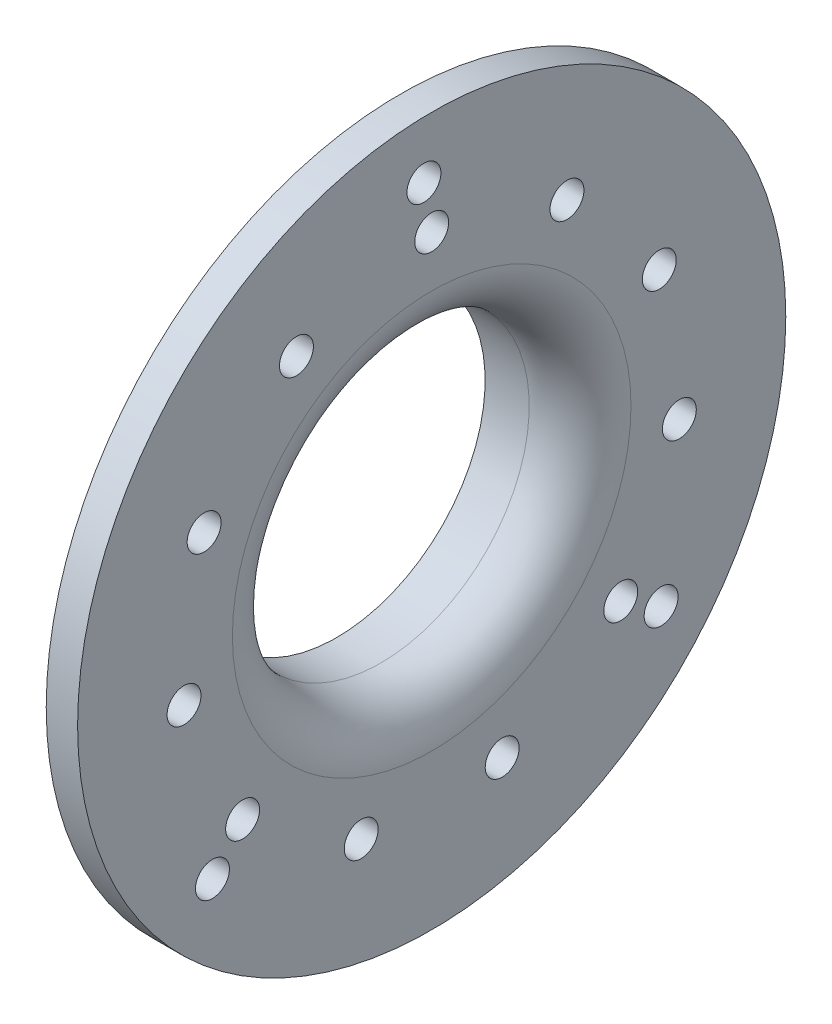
from build123d import *

# Parameters (mm, degrees)
ESQUISSE2_R                  = 2
AXE_AUBE_DEPTH               = 61.096297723
R_P_TITION_CIRCULAIRE1_COUNT = 11
ESQUISSE3_R                  = 2
ENL_V_MAT_EXTRU_1_DEPTH      = 61.096297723
R_P_TITION_CIRCULAIRE2_COUNT = 2
R_P_TITION_CIRCULAIRE2_ANGLE = 130.909090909
R_P_TITION_CIRCULAIRE3_COUNT = 2
R_P_TITION_CIRCULAIRE3_ANGLE = 130.909090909


with BuildPart() as part:
    # Esquisse1 → R_volution1 (revolve)
    with BuildSketch(Plane.XY, mode=Mode.PRIVATE) as r_volution1_sk:
        with BuildLine():
            Line((-11.2, 17.5), (-6, 17.5))
            ThreePointArc((-6, 17.5), (-1.757359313, 19.257359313), (0, 23.5))
            Line((0, 23.5), (0, 41.75))
            Line((0, 41.75), (-3.7, 41.75))
            Line((-3.7, 41.75), (-3.7, 22.2))
            ThreePointArc((-3.7, 22.2), (-4.285786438, 20.785786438), (-5.7, 20.2))
            Line((-5.7, 20.2), (-7.45, 20.2))
            Line((-7.45, 20.2), (-7.45, 19.2))
            Line((-7.45, 19.2), (-8.45, 19.2))
            Line((-8.45, 19.2), (-8.45, 20.2))
            Line((-8.45, 20.2), (-11.2, 20.2))
            Line((-11.2, 20.2), (-11.2, 17.5))
        make_face()
    revolve(r_volution1_sk.sketch.rotate(Axis((-35.807224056, 0, 0), (1, 0, 0)), 90), axis=Axis((-35.807224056, 0, 0), (1, 0, 0)))

    # Esquisse2 → Axe aube (cut, through all)
    with BuildSketch(Plane(origin=(0, 0, 0), x_dir=(0, 0, -1), z_dir=(1, 0, 0))):
        with Locations((0, 29.5)):
            Circle(ESQUISSE2_R)
    axe_aube = extrude(amount=-AXE_AUBE_DEPTH, mode=Mode.SUBTRACT)

    # R_p_tition circulaire1: Axe aube ×11 about axis
    r_p_tition_circulaire1_axis = Axis((0, 0, 0), (1, 0, 0))
    for i in range(1, R_P_TITION_CIRCULAIRE1_COUNT):
        add(axe_aube.rotate(r_p_tition_circulaire1_axis, i * 360 / R_P_TITION_CIRCULAIRE1_COUNT), mode=Mode.SUBTRACT)

    # Esquisse3 → Enl_v. mat.-Extru.1 (cut, through all)
    with BuildSketch(Plane(origin=(0, 0, 0), x_dir=(0, 0, -1), z_dir=(1, 0, 0))):
        with Locations((-0.916507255, 35)):
            Circle(ESQUISSE3_R)
    enl_v_mat_extru_1 = extrude(amount=-ENL_V_MAT_EXTRU_1_DEPTH, mode=Mode.SUBTRACT)

    # R_p_tition circulaire2: Enl_v. mat.-Extru.1 ×2 about axis
    r_p_tition_circulaire2_axis = Axis((-11.2, 0, 0), (-1, 0, 0))
    for i in range(1, R_P_TITION_CIRCULAIRE2_COUNT):
        add(enl_v_mat_extru_1.rotate(r_p_tition_circulaire2_axis, i * R_P_TITION_CIRCULAIRE2_ANGLE / (R_P_TITION_CIRCULAIRE2_COUNT - 1)), mode=Mode.SUBTRACT)

    # R_p_tition circulaire3: Enl_v. mat.-Extru.1 ×2 about axis
    r_p_tition_circulaire3_axis = Axis((-11.2, 0, 0), (1, 0, 0))
    for i in range(1, R_P_TITION_CIRCULAIRE3_COUNT):
        add(enl_v_mat_extru_1.rotate(r_p_tition_circulaire3_axis, i * R_P_TITION_CIRCULAIRE3_ANGLE / (R_P_TITION_CIRCULAIRE3_COUNT - 1)), mode=Mode.SUBTRACT)


solid = part.part
